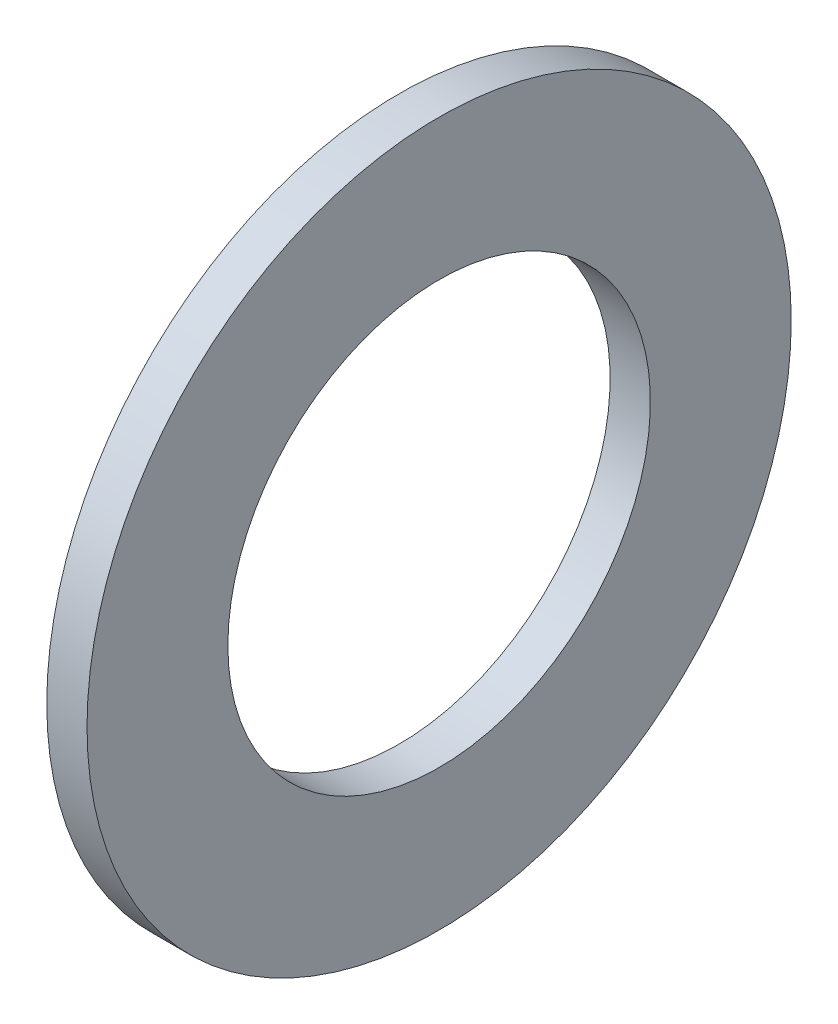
ISO-10303-21;
HEADER;
FILE_DESCRIPTION(('STEP AP214'),'2;1');
FILE_NAME('part.step','',(''),(''),'','','');
FILE_SCHEMA(('AUTOMOTIVE_DESIGN { 1 0 10303 214 1 1 1 1 }'));
ENDSEC;
DATA;
#1=APPLICATION_CONTEXT('core data for automotive mechanical design processes');
#2=APPLICATION_PROTOCOL_DEFINITION('international standard','automotive_design',2000,#1);
#3=PRODUCT_CONTEXT('',#1,'mechanical');
#4=PRODUCT('Part','Part','',(#3));
#5=PRODUCT_RELATED_PRODUCT_CATEGORY('part','',(#4));
#6=PRODUCT_DEFINITION_FORMATION('','',#4);
#7=PRODUCT_DEFINITION_CONTEXT('part definition',#1,'design');
#8=PRODUCT_DEFINITION('design','',#6,#7);
#9=PRODUCT_DEFINITION_SHAPE('','',#8);
#10=(LENGTH_UNIT() NAMED_UNIT(*) SI_UNIT(.MILLI.,.METRE.));
#11=(NAMED_UNIT(*) PLANE_ANGLE_UNIT() SI_UNIT($,.RADIAN.));
#12=(NAMED_UNIT(*) SI_UNIT($,.STERADIAN.) SOLID_ANGLE_UNIT());
#13=UNCERTAINTY_MEASURE_WITH_UNIT(LENGTH_MEASURE(1.E-05),#10,'distance_accuracy_value','');
#14=(GEOMETRIC_REPRESENTATION_CONTEXT(3) GLOBAL_UNCERTAINTY_ASSIGNED_CONTEXT((#13)) GLOBAL_UNIT_ASSIGNED_CONTEXT((#10,
#11,#12)) REPRESENTATION_CONTEXT('',''));
#15=CARTESIAN_POINT('',(0.,0.,0.));
#16=DIRECTION('',(0.,0.,1.));
#17=DIRECTION('',(1.,0.,0.));
#18=AXIS2_PLACEMENT_3D('',#15,#16,#17);
#19=CARTESIAN_POINT('',(-0.4,0.,0.));
#20=DIRECTION('',(-1.,0.,0.));
#21=DIRECTION('',(0.,0.,1.));
#22=AXIS2_PLACEMENT_3D('',#19,#20,#21);
#23=PLANE('',#22);
#24=CARTESIAN_POINT('',(-0.4,0.,0.));
#25=DIRECTION('',(-1.,0.,0.));
#26=DIRECTION('',(0.,0.,1.));
#27=AXIS2_PLACEMENT_3D('',#24,#25,#26);
#28=CIRCLE('',#27,2.1);
#29=CARTESIAN_POINT('',(-0.4,0.,2.1));
#30=VERTEX_POINT('',#29);
#31=EDGE_CURVE('E26',#30,#30,#28,.F.);
#32=ORIENTED_EDGE('',*,*,#31,.T.);
#33=EDGE_LOOP('',(#32));
#34=FACE_BOUND('',#33,.T.);
#35=CARTESIAN_POINT('',(-0.4,0.,0.));
#36=DIRECTION('',(-1.,0.,0.));
#37=DIRECTION('',(0.,0.,1.));
#38=AXIS2_PLACEMENT_3D('',#35,#36,#37);
#39=CIRCLE('',#38,3.5);
#40=CARTESIAN_POINT('',(-0.4,0.,3.5));
#41=VERTEX_POINT('',#40);
#42=EDGE_CURVE('E17',#41,#41,#39,.F.);
#43=ORIENTED_EDGE('',*,*,#42,.F.);
#44=EDGE_LOOP('',(#43));
#45=FACE_BOUND('',#44,.T.);
#46=ADVANCED_FACE('F14',(#34,#45),#23,.T.);
#47=CARTESIAN_POINT('',(0.02,0.,0.));
#48=DIRECTION('',(-1.,0.,0.));
#49=DIRECTION('',(0.,0.,1.));
#50=AXIS2_PLACEMENT_3D('',#47,#48,#49);
#51=CYLINDRICAL_SURFACE('',#50,3.5);
#52=ORIENTED_EDGE('',*,*,#42,.T.);
#53=EDGE_LOOP('',(#52));
#54=FACE_BOUND('',#53,.T.);
#55=CARTESIAN_POINT('',(0.,0.,0.));
#56=DIRECTION('',(-1.,0.,0.));
#57=DIRECTION('',(0.,0.,1.));
#58=AXIS2_PLACEMENT_3D('',#55,#56,#57);
#59=CIRCLE('',#58,3.5);
#60=CARTESIAN_POINT('',(0.,0.,3.5));
#61=VERTEX_POINT('',#60);
#62=EDGE_CURVE('E21',#61,#61,#59,.T.);
#63=ORIENTED_EDGE('',*,*,#62,.T.);
#64=EDGE_LOOP('',(#63));
#65=FACE_BOUND('',#64,.T.);
#66=ADVANCED_FACE('F34',(#54,#65),#51,.T.);
#67=CARTESIAN_POINT('',(0.02,0.,0.));
#68=DIRECTION('',(-1.,0.,0.));
#69=DIRECTION('',(0.,0.,1.));
#70=AXIS2_PLACEMENT_3D('',#67,#68,#69);
#71=CYLINDRICAL_SURFACE('',#70,2.1);
#72=ORIENTED_EDGE('',*,*,#31,.F.);
#73=EDGE_LOOP('',(#72));
#74=FACE_BOUND('',#73,.T.);
#75=CARTESIAN_POINT('',(0.,0.,0.));
#76=DIRECTION('',(-1.,0.,0.));
#77=DIRECTION('',(0.,0.,1.));
#78=AXIS2_PLACEMENT_3D('',#75,#76,#77);
#79=CIRCLE('',#78,2.1);
#80=CARTESIAN_POINT('',(0.,0.,2.1));
#81=VERTEX_POINT('',#80);
#82=EDGE_CURVE('E10',#81,#81,#79,.F.);
#83=ORIENTED_EDGE('',*,*,#82,.T.);
#84=EDGE_LOOP('',(#83));
#85=FACE_BOUND('',#84,.T.);
#86=ADVANCED_FACE('F42',(#74,#85),#71,.F.);
#87=CARTESIAN_POINT('',(0.,0.,0.));
#88=DIRECTION('',(-1.,0.,0.));
#89=DIRECTION('',(0.,0.,1.));
#90=AXIS2_PLACEMENT_3D('',#87,#88,#89);
#91=PLANE('',#90);
#92=ORIENTED_EDGE('',*,*,#82,.F.);
#93=EDGE_LOOP('',(#92));
#94=FACE_BOUND('',#93,.T.);
#95=ORIENTED_EDGE('',*,*,#62,.F.);
#96=EDGE_LOOP('',(#95));
#97=FACE_BOUND('',#96,.T.);
#98=ADVANCED_FACE('F43',(#94,#97),#91,.F.);
#99=CLOSED_SHELL('',(#46,#66,#86,#98));
#100=MANIFOLD_SOLID_BREP('B1',#99);
#101=ADVANCED_BREP_SHAPE_REPRESENTATION('',(#18,#100),#14);
#102=SHAPE_DEFINITION_REPRESENTATION(#9,#101);
ENDSEC;
END-ISO-10303-21;
